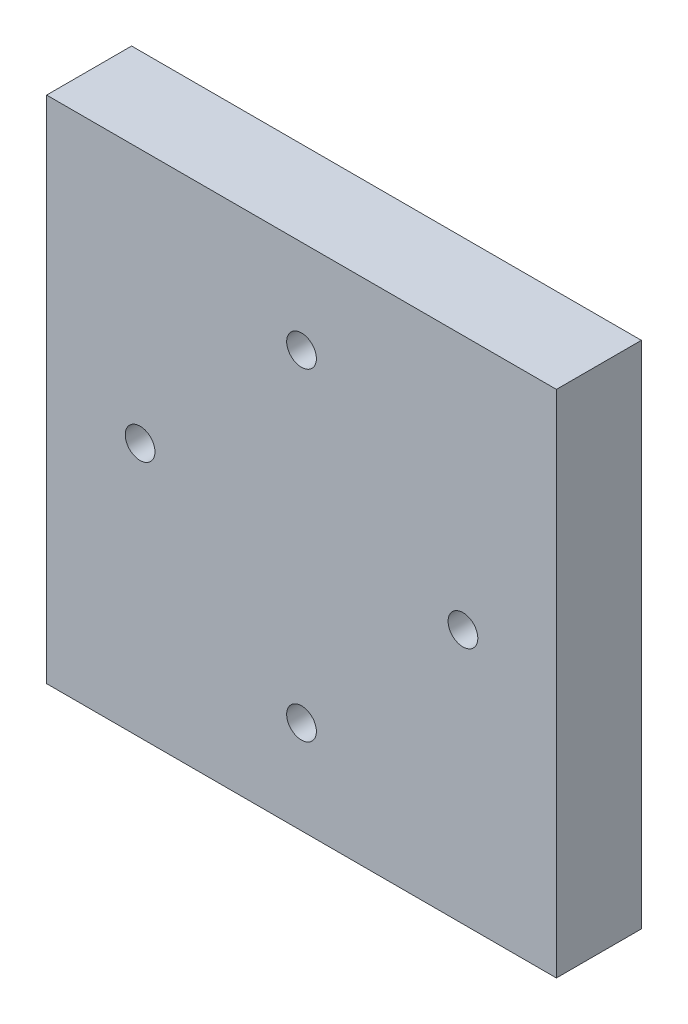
from build123d import *

# Parameters (mm, degrees)
ESQUISSE1_W                  = 300
ESQUISSE1_H                  = 300
EXTRUSION1_DEPTH             = 50
R_P_TITION_CIRCULAIRE2_COUNT = 4


with BuildPart() as part:
    # Esquisse1 → Extrusion1 (new body)
    with BuildSketch(Plane.XY):
        with Locations((150, 150)):
            Rectangle(ESQUISSE1_W, ESQUISSE1_H)
    extrude(amount=EXTRUSION1_DEPTH)

    # Esquisse7 → Trou taraud_ M202 (revolve, cut)
    with BuildSketch(Plane(origin=(150, 245, 50), x_dir=(0, -1, 0), z_dir=(1, 0, 0))):
        Polygon((0, 0), (0, 35.257530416), (8.75, 30), (8.75, 0), align=None)
    trou_taraud_m202 = revolve(axis=Axis((150, 245, 56.35), (0, 0, -1)), mode=Mode.SUBTRACT)

    # R_p_tition circulaire2: Trou taraud_ M202 ×4 about axis
    r_p_tition_circulaire2_axis = Axis((150, 150, 0), (0, 0, 1))
    for i in range(1, R_P_TITION_CIRCULAIRE2_COUNT):
        add(trou_taraud_m202.rotate(r_p_tition_circulaire2_axis, i * 360 / R_P_TITION_CIRCULAIRE2_COUNT), mode=Mode.SUBTRACT)


solid = part.part
